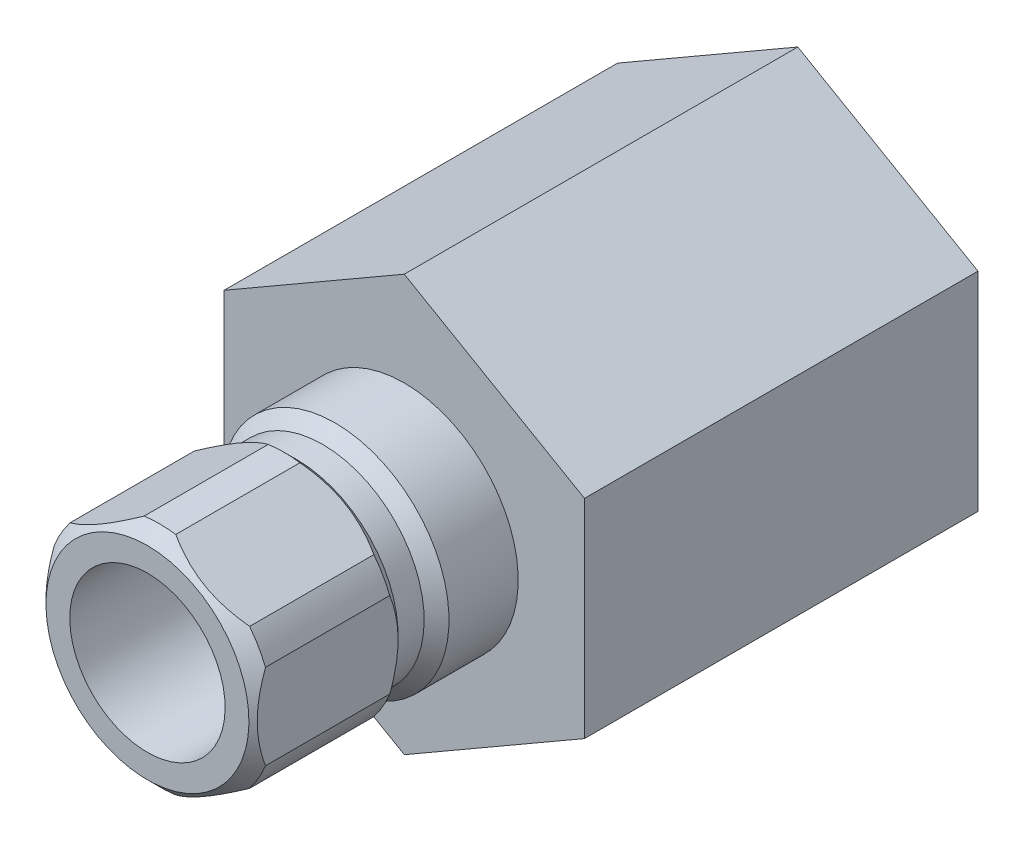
ISO-10303-21;
HEADER;
FILE_DESCRIPTION(('STEP AP214'),'2;1');
FILE_NAME('part.step','',(''),(''),'','','');
FILE_SCHEMA(('AUTOMOTIVE_DESIGN { 1 0 10303 214 1 1 1 1 }'));
ENDSEC;
DATA;
#1=APPLICATION_CONTEXT('core data for automotive mechanical design processes');
#2=APPLICATION_PROTOCOL_DEFINITION('international standard','automotive_design',2000,#1);
#3=PRODUCT_CONTEXT('',#1,'mechanical');
#4=PRODUCT('Part','Part','',(#3));
#5=PRODUCT_RELATED_PRODUCT_CATEGORY('part','',(#4));
#6=PRODUCT_DEFINITION_FORMATION('','',#4);
#7=PRODUCT_DEFINITION_CONTEXT('part definition',#1,'design');
#8=PRODUCT_DEFINITION('design','',#6,#7);
#9=PRODUCT_DEFINITION_SHAPE('','',#8);
#10=(LENGTH_UNIT() NAMED_UNIT(*) SI_UNIT(.MILLI.,.METRE.));
#11=(NAMED_UNIT(*) PLANE_ANGLE_UNIT() SI_UNIT($,.RADIAN.));
#12=(NAMED_UNIT(*) SI_UNIT($,.STERADIAN.) SOLID_ANGLE_UNIT());
#13=UNCERTAINTY_MEASURE_WITH_UNIT(LENGTH_MEASURE(1.E-05),#10,'distance_accuracy_value','');
#14=(GEOMETRIC_REPRESENTATION_CONTEXT(3) GLOBAL_UNCERTAINTY_ASSIGNED_CONTEXT((#13)) GLOBAL_UNIT_ASSIGNED_CONTEXT((#10,
#11,#12)) REPRESENTATION_CONTEXT('',''));
#15=CARTESIAN_POINT('',(0.,0.,0.));
#16=DIRECTION('',(0.,0.,1.));
#17=DIRECTION('',(1.,0.,0.));
#18=AXIS2_PLACEMENT_3D('',#15,#16,#17);
#19=CARTESIAN_POINT('',(0.,0.,0.));
#20=DIRECTION('',(0.,0.,-1.));
#21=DIRECTION('',(0.,1.,0.));
#22=AXIS2_PLACEMENT_3D('',#19,#20,#21);
#23=CYLINDRICAL_SURFACE('',#22,6.985);
#24=DIRECTION('',(0.,0.,-1.));
#25=VECTOR('',#24,1.);
#26=CARTESIAN_POINT('',(-5.50323442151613,4.30170151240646,0.));
#27=LINE('',#26,#25);
#28=CARTESIAN_POINT('',(-5.50323442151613,4.30170151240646,7.366));
#29=VERTEX_POINT('',#28);
#30=CARTESIAN_POINT('',(-5.50323442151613,4.30170151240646,14.986));
#31=VERTEX_POINT('',#30);
#32=EDGE_CURVE('E54',#29,#31,#27,.F.);
#33=ORIENTED_EDGE('',*,*,#32,.F.);
#34=CARTESIAN_POINT('',(0.,0.,7.366));
#35=DIRECTION('',(0.,0.,-1.));
#36=DIRECTION('',(0.,1.,0.));
#37=AXIS2_PLACEMENT_3D('',#34,#35,#36);
#38=CIRCLE('',#37,6.985);
#39=CARTESIAN_POINT('',(-6.477,2.6150900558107,7.366));
#40=VERTEX_POINT('',#39);
#41=EDGE_CURVE('E195',#40,#29,#38,.T.);
#42=ORIENTED_EDGE('',*,*,#41,.F.);
#43=DIRECTION('',(0.,0.,-1.));
#44=VECTOR('',#43,1.);
#45=CARTESIAN_POINT('',(-6.477,2.6150900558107,0.));
#46=LINE('',#45,#44);
#47=CARTESIAN_POINT('',(-6.477,2.6150900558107,14.986));
#48=VERTEX_POINT('',#47);
#49=EDGE_CURVE('E375',#48,#40,#46,.T.);
#50=ORIENTED_EDGE('',*,*,#49,.F.);
#51=CARTESIAN_POINT('',(0.,0.,14.986));
#52=DIRECTION('',(0.,0.,-1.));
#53=DIRECTION('',(0.,1.,0.));
#54=AXIS2_PLACEMENT_3D('',#51,#52,#53);
#55=CIRCLE('',#54,6.985);
#56=EDGE_CURVE('E200',#48,#31,#55,.T.);
#57=ORIENTED_EDGE('',*,*,#56,.T.);
#58=EDGE_LOOP('',(#33,#42,#50,#57));
#59=FACE_BOUND('',#58,.T.);
#60=ADVANCED_FACE('F35',(#59),#23,.T.);
#61=DIRECTION('',(0.,0.,-1.));
#62=VECTOR('',#61,1.);
#63=CARTESIAN_POINT('',(-6.477,-2.6150900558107,0.));
#64=LINE('',#63,#62);
#65=CARTESIAN_POINT('',(-6.477,-2.6150900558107,7.366));
#66=VERTEX_POINT('',#65);
#67=CARTESIAN_POINT('',(-6.477,-2.6150900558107,14.986));
#68=VERTEX_POINT('',#67);
#69=EDGE_CURVE('E62',#66,#68,#64,.F.);
#70=ORIENTED_EDGE('',*,*,#69,.F.);
#71=CARTESIAN_POINT('',(-5.50323442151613,-4.30170151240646,7.366));
#72=VERTEX_POINT('',#71);
#73=EDGE_CURVE('E432',#72,#66,#38,.T.);
#74=ORIENTED_EDGE('',*,*,#73,.F.);
#75=DIRECTION('',(0.,0.,-1.));
#76=VECTOR('',#75,1.);
#77=CARTESIAN_POINT('',(-5.50323442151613,-4.30170151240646,0.));
#78=LINE('',#77,#76);
#79=CARTESIAN_POINT('',(-5.50323442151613,-4.30170151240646,14.986));
#80=VERTEX_POINT('',#79);
#81=EDGE_CURVE('E370',#80,#72,#78,.T.);
#82=ORIENTED_EDGE('',*,*,#81,.F.);
#83=EDGE_CURVE('E205',#80,#68,#55,.T.);
#84=ORIENTED_EDGE('',*,*,#83,.T.);
#85=EDGE_LOOP('',(#70,#74,#82,#84));
#86=FACE_BOUND('',#85,.T.);
#87=ADVANCED_FACE('F367',(#86),#23,.T.);
#88=DIRECTION('',(0.,0.,-1.));
#89=VECTOR('',#88,1.);
#90=CARTESIAN_POINT('',(-0.973765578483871,-6.91679156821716,0.));
#91=LINE('',#90,#89);
#92=CARTESIAN_POINT('',(-0.973765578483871,-6.91679156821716,7.366));
#93=VERTEX_POINT('',#92);
#94=CARTESIAN_POINT('',(-0.973765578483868,-6.91679156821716,14.986));
#95=VERTEX_POINT('',#94);
#96=EDGE_CURVE('E381',#93,#95,#91,.F.);
#97=ORIENTED_EDGE('',*,*,#96,.F.);
#98=CARTESIAN_POINT('',(0.973765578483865,-6.91679156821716,7.366));
#99=VERTEX_POINT('',#98);
#100=EDGE_CURVE('E430',#99,#93,#38,.T.);
#101=ORIENTED_EDGE('',*,*,#100,.F.);
#102=DIRECTION('',(0.,0.,-1.));
#103=VECTOR('',#102,1.);
#104=CARTESIAN_POINT('',(0.973765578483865,-6.91679156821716,0.));
#105=LINE('',#104,#103);
#106=CARTESIAN_POINT('',(0.973765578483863,-6.91679156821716,14.986));
#107=VERTEX_POINT('',#106);
#108=EDGE_CURVE('E416',#107,#99,#105,.T.);
#109=ORIENTED_EDGE('',*,*,#108,.F.);
#110=EDGE_CURVE('E198',#107,#95,#55,.T.);
#111=ORIENTED_EDGE('',*,*,#110,.T.);
#112=EDGE_LOOP('',(#97,#101,#109,#111));
#113=FACE_BOUND('',#112,.T.);
#114=ADVANCED_FACE('F429',(#113),#23,.T.);
#115=DIRECTION('',(0.,0.,-1.));
#116=VECTOR('',#115,1.);
#117=CARTESIAN_POINT('',(5.50323442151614,-4.30170151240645,0.));
#118=LINE('',#117,#116);
#119=CARTESIAN_POINT('',(5.50323442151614,-4.30170151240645,7.366));
#120=VERTEX_POINT('',#119);
#121=CARTESIAN_POINT('',(5.50323442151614,-4.30170151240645,14.986));
#122=VERTEX_POINT('',#121);
#123=EDGE_CURVE('E418',#120,#122,#118,.F.);
#124=ORIENTED_EDGE('',*,*,#123,.F.);
#125=CARTESIAN_POINT('',(6.477,-2.6150900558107,7.366));
#126=VERTEX_POINT('',#125);
#127=EDGE_CURVE('E357',#126,#120,#38,.T.);
#128=ORIENTED_EDGE('',*,*,#127,.F.);
#129=DIRECTION('',(0.,0.,-1.));
#130=VECTOR('',#129,1.);
#131=CARTESIAN_POINT('',(6.477,-2.6150900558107,0.));
#132=LINE('',#131,#130);
#133=CARTESIAN_POINT('',(6.477,-2.6150900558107,14.986));
#134=VERTEX_POINT('',#133);
#135=EDGE_CURVE('E349',#134,#126,#132,.T.);
#136=ORIENTED_EDGE('',*,*,#135,.F.);
#137=EDGE_CURVE('E191',#134,#122,#55,.T.);
#138=ORIENTED_EDGE('',*,*,#137,.T.);
#139=EDGE_LOOP('',(#124,#128,#136,#138));
#140=FACE_BOUND('',#139,.T.);
#141=ADVANCED_FACE('F355',(#140),#23,.T.);
#142=DIRECTION('',(0.,0.,-1.));
#143=VECTOR('',#142,1.);
#144=CARTESIAN_POINT('',(6.477,2.6150900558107,0.));
#145=LINE('',#144,#143);
#146=CARTESIAN_POINT('',(6.477,2.6150900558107,7.366));
#147=VERTEX_POINT('',#146);
#148=CARTESIAN_POINT('',(6.477,2.6150900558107,14.986));
#149=VERTEX_POINT('',#148);
#150=EDGE_CURVE('E351',#147,#149,#145,.F.);
#151=ORIENTED_EDGE('',*,*,#150,.F.);
#152=CARTESIAN_POINT('',(5.50323442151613,4.30170151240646,7.366));
#153=VERTEX_POINT('',#152);
#154=EDGE_CURVE('E184',#153,#147,#38,.T.);
#155=ORIENTED_EDGE('',*,*,#154,.F.);
#156=DIRECTION('',(0.,0.,-1.));
#157=VECTOR('',#156,1.);
#158=CARTESIAN_POINT('',(5.50323442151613,4.30170151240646,0.));
#159=LINE('',#158,#157);
#160=CARTESIAN_POINT('',(5.50323442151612,4.30170151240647,14.986));
#161=VERTEX_POINT('',#160);
#162=EDGE_CURVE('E166',#161,#153,#159,.T.);
#163=ORIENTED_EDGE('',*,*,#162,.F.);
#164=EDGE_CURVE('E182',#161,#149,#55,.T.);
#165=ORIENTED_EDGE('',*,*,#164,.T.);
#166=EDGE_LOOP('',(#151,#155,#163,#165));
#167=FACE_BOUND('',#166,.T.);
#168=ADVANCED_FACE('F181',(#167),#23,.T.);
#169=CARTESIAN_POINT('',(0.,13.208,-24.13));
#170=DIRECTION('',(0.,0.,-1.));
#171=DIRECTION('',(0.,1.,0.));
#172=AXIS2_PLACEMENT_3D('',#169,#170,#171);
#173=PLANE('',#172);
#174=CARTESIAN_POINT('',(0.,0.,-24.13));
#175=DIRECTION('',(0.,0.,-1.));
#176=DIRECTION('',(0.,1.,0.));
#177=AXIS2_PLACEMENT_3D('',#174,#175,#176);
#178=CIRCLE('',#177,9.40283906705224);
#179=CARTESIAN_POINT('',(0.,9.40283906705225,-24.13));
#180=VERTEX_POINT('',#179);
#181=EDGE_CURVE('E446',#180,#180,#178,.T.);
#182=ORIENTED_EDGE('',*,*,#181,.F.);
#183=EDGE_LOOP('',(#182));
#184=FACE_BOUND('',#183,.T.);
#185=DIRECTION('',(0.,-1.,0.));
#186=VECTOR('',#185,1.);
#187=CARTESIAN_POINT('',(-11.049,6.37914312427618,-24.13));
#188=LINE('',#187,#186);
#189=CARTESIAN_POINT('',(-11.049,6.37914312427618,-24.13));
#190=VERTEX_POINT('',#189);
#191=CARTESIAN_POINT('',(-11.049,-6.37914312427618,-24.13));
#192=VERTEX_POINT('',#191);
#193=EDGE_CURVE('E257',#190,#192,#188,.T.);
#194=ORIENTED_EDGE('',*,*,#193,.F.);
#195=DIRECTION('',(-0.866025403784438,-0.5,0.));
#196=VECTOR('',#195,1.);
#197=CARTESIAN_POINT('',(0.,12.7582862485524,-24.13));
#198=LINE('',#197,#196);
#199=CARTESIAN_POINT('',(0.,12.7582862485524,-24.13));
#200=VERTEX_POINT('',#199);
#201=EDGE_CURVE('E229',#200,#190,#198,.T.);
#202=ORIENTED_EDGE('',*,*,#201,.F.);
#203=DIRECTION('',(-0.866025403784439,0.5,0.));
#204=VECTOR('',#203,1.);
#205=CARTESIAN_POINT('',(11.049,6.37914312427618,-24.13));
#206=LINE('',#205,#204);
#207=CARTESIAN_POINT('',(11.049,6.37914312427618,-24.13));
#208=VERTEX_POINT('',#207);
#209=EDGE_CURVE('E216',#208,#200,#206,.T.);
#210=ORIENTED_EDGE('',*,*,#209,.F.);
#211=DIRECTION('',(0.,1.,0.));
#212=VECTOR('',#211,1.);
#213=CARTESIAN_POINT('',(11.049,-6.37914312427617,-24.13));
#214=LINE('',#213,#212);
#215=CARTESIAN_POINT('',(11.049,-6.37914312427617,-24.13));
#216=VERTEX_POINT('',#215);
#217=EDGE_CURVE('E248',#216,#208,#214,.T.);
#218=ORIENTED_EDGE('',*,*,#217,.F.);
#219=DIRECTION('',(0.866025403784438,0.5,0.));
#220=VECTOR('',#219,1.);
#221=CARTESIAN_POINT('',(0.,-12.7582862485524,-24.13));
#222=LINE('',#221,#220);
#223=CARTESIAN_POINT('',(0.,-12.7582862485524,-24.13));
#224=VERTEX_POINT('',#223);
#225=EDGE_CURVE('E251',#224,#216,#222,.T.);
#226=ORIENTED_EDGE('',*,*,#225,.F.);
#227=DIRECTION('',(0.866025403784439,-0.5,0.));
#228=VECTOR('',#227,1.);
#229=CARTESIAN_POINT('',(-11.049,-6.37914312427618,-24.13));
#230=LINE('',#229,#228);
#231=EDGE_CURVE('E254',#192,#224,#230,.T.);
#232=ORIENTED_EDGE('',*,*,#231,.F.);
#233=EDGE_LOOP('',(#194,#202,#210,#218,#226,#232));
#234=FACE_BOUND('',#233,.T.);
#235=ADVANCED_FACE('F478',(#184,#234),#173,.T.);
#236=CARTESIAN_POINT('',(0.,6.985,0.));
#237=DIRECTION('',(0.,0.,1.));
#238=DIRECTION('',(0.,-1.,0.));
#239=AXIS2_PLACEMENT_3D('',#236,#237,#238);
#240=PLANE('',#239);
#241=CARTESIAN_POINT('',(0.,0.,0.));
#242=DIRECTION('',(0.,0.,-1.));
#243=DIRECTION('',(0.,1.,0.));
#244=AXIS2_PLACEMENT_3D('',#241,#242,#243);
#245=CIRCLE('',#244,6.985);
#246=CARTESIAN_POINT('',(0.,6.985,0.));
#247=VERTEX_POINT('',#246);
#248=EDGE_CURVE('E443',#247,#247,#245,.T.);
#249=ORIENTED_EDGE('',*,*,#248,.T.);
#250=EDGE_LOOP('',(#249));
#251=FACE_BOUND('',#250,.T.);
#252=DIRECTION('',(-0.866025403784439,0.5,0.));
#253=VECTOR('',#252,1.);
#254=CARTESIAN_POINT('',(11.049,6.37914312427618,0.));
#255=LINE('',#254,#253);
#256=CARTESIAN_POINT('',(11.049,6.37914312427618,0.));
#257=VERTEX_POINT('',#256);
#258=CARTESIAN_POINT('',(0.,12.7582862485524,0.));
#259=VERTEX_POINT('',#258);
#260=EDGE_CURVE('E226',#257,#259,#255,.T.);
#261=ORIENTED_EDGE('',*,*,#260,.T.);
#262=DIRECTION('',(-0.866025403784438,-0.5,0.));
#263=VECTOR('',#262,1.);
#264=CARTESIAN_POINT('',(0.,12.7582862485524,0.));
#265=LINE('',#264,#263);
#266=CARTESIAN_POINT('',(-11.049,6.37914312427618,0.));
#267=VERTEX_POINT('',#266);
#268=EDGE_CURVE('E242',#259,#267,#265,.T.);
#269=ORIENTED_EDGE('',*,*,#268,.T.);
#270=DIRECTION('',(0.,-1.,0.));
#271=VECTOR('',#270,1.);
#272=CARTESIAN_POINT('',(-11.049,6.37914312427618,0.));
#273=LINE('',#272,#271);
#274=CARTESIAN_POINT('',(-11.049,-6.37914312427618,0.));
#275=VERTEX_POINT('',#274);
#276=EDGE_CURVE('E239',#267,#275,#273,.T.);
#277=ORIENTED_EDGE('',*,*,#276,.T.);
#278=DIRECTION('',(0.866025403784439,-0.5,0.));
#279=VECTOR('',#278,1.);
#280=CARTESIAN_POINT('',(-11.049,-6.37914312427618,0.));
#281=LINE('',#280,#279);
#282=CARTESIAN_POINT('',(0.,-12.7582862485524,0.));
#283=VERTEX_POINT('',#282);
#284=EDGE_CURVE('E236',#275,#283,#281,.T.);
#285=ORIENTED_EDGE('',*,*,#284,.T.);
#286=DIRECTION('',(0.866025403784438,0.5,0.));
#287=VECTOR('',#286,1.);
#288=CARTESIAN_POINT('',(0.,-12.7582862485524,0.));
#289=LINE('',#288,#287);
#290=CARTESIAN_POINT('',(11.049,-6.37914312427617,0.));
#291=VERTEX_POINT('',#290);
#292=EDGE_CURVE('E233',#283,#291,#289,.T.);
#293=ORIENTED_EDGE('',*,*,#292,.T.);
#294=DIRECTION('',(0.,1.,0.));
#295=VECTOR('',#294,1.);
#296=CARTESIAN_POINT('',(11.049,-6.37914312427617,0.));
#297=LINE('',#296,#295);
#298=EDGE_CURVE('E230',#291,#257,#297,.T.);
#299=ORIENTED_EDGE('',*,*,#298,.T.);
#300=EDGE_LOOP('',(#261,#269,#277,#285,#293,#299));
#301=FACE_BOUND('',#300,.T.);
#302=ADVANCED_FACE('F467',(#251,#301),#240,.T.);
#303=CARTESIAN_POINT('',(0.,0.,0.));
#304=DIRECTION('',(0.,0.,-1.));
#305=DIRECTION('',(0.,1.,0.));
#306=AXIS2_PLACEMENT_3D('',#303,#304,#305);
#307=CYLINDRICAL_SURFACE('',#306,4.7625);
#308=CARTESIAN_POINT('',(0.,0.,-8.97890000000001));
#309=DIRECTION('',(0.,0.,-1.));
#310=DIRECTION('',(0.,1.,0.));
#311=AXIS2_PLACEMENT_3D('',#308,#309,#310);
#312=CIRCLE('',#311,4.7625);
#313=CARTESIAN_POINT('',(0.,4.7625,-8.97890000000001));
#314=VERTEX_POINT('',#313);
#315=EDGE_CURVE('E175',#314,#314,#312,.T.);
#316=ORIENTED_EDGE('',*,*,#315,.T.);
#317=EDGE_LOOP('',(#316));
#318=FACE_BOUND('',#317,.T.);
#319=CARTESIAN_POINT('',(0.,0.,15.748));
#320=DIRECTION('',(0.,0.,-1.));
#321=DIRECTION('',(0.,1.,0.));
#322=AXIS2_PLACEMENT_3D('',#319,#320,#321);
#323=CIRCLE('',#322,4.7625);
#324=CARTESIAN_POINT('',(0.,4.7625,15.748));
#325=VERTEX_POINT('',#324);
#326=EDGE_CURVE('E207',#325,#325,#323,.T.);
#327=ORIENTED_EDGE('',*,*,#326,.F.);
#328=EDGE_LOOP('',(#327));
#329=FACE_BOUND('',#328,.T.);
#330=ADVANCED_FACE('F37',(#318,#329),#307,.F.);
#331=CARTESIAN_POINT('',(0.,4.7625,-8.97890000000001));
#332=DIRECTION('',(0.,0.,-1.));
#333=DIRECTION('',(0.,1.,0.));
#334=AXIS2_PLACEMENT_3D('',#331,#332,#333);
#335=PLANE('',#334);
#336=CARTESIAN_POINT('',(0.,0.,-8.97890000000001));
#337=DIRECTION('',(0.,0.,-1.));
#338=DIRECTION('',(0.,1.,0.));
#339=AXIS2_PLACEMENT_3D('',#336,#337,#338);
#340=CIRCLE('',#339,8.92937);
#341=CARTESIAN_POINT('',(0.,8.92937,-8.97890000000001));
#342=VERTEX_POINT('',#341);
#343=EDGE_CURVE('E449',#342,#342,#340,.T.);
#344=ORIENTED_EDGE('',*,*,#343,.T.);
#345=EDGE_LOOP('',(#344));
#346=FACE_BOUND('',#345,.T.);
#347=ORIENTED_EDGE('',*,*,#315,.F.);
#348=EDGE_LOOP('',(#347));
#349=FACE_BOUND('',#348,.T.);
#350=ADVANCED_FACE('F456',(#346,#349),#335,.T.);
#351=CARTESIAN_POINT('',(0.,0.,-8.97890000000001));
#352=DIRECTION('',(0.,0.,-1.));
#353=DIRECTION('',(0.,1.,0.));
#354=AXIS2_PLACEMENT_3D('',#351,#352,#353);
#355=CONICAL_SURFACE('',#354,8.92937,0.0312396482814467);
#356=ORIENTED_EDGE('',*,*,#181,.T.);
#357=EDGE_LOOP('',(#356));
#358=FACE_BOUND('',#357,.T.);
#359=ORIENTED_EDGE('',*,*,#343,.F.);
#360=EDGE_LOOP('',(#359));
#361=FACE_BOUND('',#360,.T.);
#362=ADVANCED_FACE('F458',(#358,#361),#355,.F.);
#363=CARTESIAN_POINT('',(0.,0.,0.));
#364=DIRECTION('',(0.,0.,-1.));
#365=DIRECTION('',(0.,1.,0.));
#366=AXIS2_PLACEMENT_3D('',#363,#364,#365);
#367=CYLINDRICAL_SURFACE('',#366,6.985);
#368=CARTESIAN_POINT('',(0.,0.,4.2418));
#369=DIRECTION('',(0.,0.,-1.));
#370=DIRECTION('',(0.,1.,0.));
#371=AXIS2_PLACEMENT_3D('',#368,#369,#370);
#372=CIRCLE('',#371,6.985);
#373=CARTESIAN_POINT('',(0.,6.985,4.2418));
#374=VERTEX_POINT('',#373);
#375=EDGE_CURVE('E440',#374,#374,#372,.T.);
#376=ORIENTED_EDGE('',*,*,#375,.T.);
#377=EDGE_LOOP('',(#376));
#378=FACE_BOUND('',#377,.T.);
#379=ORIENTED_EDGE('',*,*,#248,.F.);
#380=EDGE_LOOP('',(#379));
#381=FACE_BOUND('',#380,.T.);
#382=ADVANCED_FACE('F464',(#378,#381),#367,.T.);
#383=CARTESIAN_POINT('',(0.,0.,4.2418));
#384=DIRECTION('',(0.,0.,-1.));
#385=DIRECTION('',(0.,1.,0.));
#386=AXIS2_PLACEMENT_3D('',#383,#384,#385);
#387=CONICAL_SURFACE('',#386,6.985,0.785398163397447);
#388=CARTESIAN_POINT('',(0.,0.,5.0038));
#389=DIRECTION('',(0.,0.,-1.));
#390=DIRECTION('',(0.,1.,0.));
#391=AXIS2_PLACEMENT_3D('',#388,#389,#390);
#392=CIRCLE('',#391,6.223);
#393=CARTESIAN_POINT('',(0.,6.223,5.0038));
#394=VERTEX_POINT('',#393);
#395=EDGE_CURVE('E437',#394,#394,#392,.T.);
#396=ORIENTED_EDGE('',*,*,#395,.T.);
#397=EDGE_LOOP('',(#396));
#398=FACE_BOUND('',#397,.T.);
#399=ORIENTED_EDGE('',*,*,#375,.F.);
#400=EDGE_LOOP('',(#399));
#401=FACE_BOUND('',#400,.T.);
#402=ADVANCED_FACE('F567',(#398,#401),#387,.T.);
#403=CARTESIAN_POINT('',(0.,0.,0.));
#404=DIRECTION('',(0.,0.,-1.));
#405=DIRECTION('',(0.,1.,0.));
#406=AXIS2_PLACEMENT_3D('',#403,#404,#405);
#407=CYLINDRICAL_SURFACE('',#406,6.223);
#408=CARTESIAN_POINT('',(0.,0.,6.604));
#409=DIRECTION('',(0.,0.,-1.));
#410=DIRECTION('',(0.,1.,0.));
#411=AXIS2_PLACEMENT_3D('',#408,#409,#410);
#412=CIRCLE('',#411,6.223);
#413=CARTESIAN_POINT('',(0.,6.223,6.604));
#414=VERTEX_POINT('',#413);
#415=EDGE_CURVE('E434',#414,#414,#412,.T.);
#416=ORIENTED_EDGE('',*,*,#415,.T.);
#417=EDGE_LOOP('',(#416));
#418=FACE_BOUND('',#417,.T.);
#419=ORIENTED_EDGE('',*,*,#395,.F.);
#420=EDGE_LOOP('',(#419));
#421=FACE_BOUND('',#420,.T.);
#422=ADVANCED_FACE('F476',(#418,#421),#407,.T.);
#423=CARTESIAN_POINT('',(0.,0.,6.604));
#424=DIRECTION('',(0.,0.,1.));
#425=DIRECTION('',(0.,-1.,0.));
#426=AXIS2_PLACEMENT_3D('',#423,#424,#425);
#427=CONICAL_SURFACE('',#426,6.223,0.785398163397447);
#428=CARTESIAN_POINT('',(-0.973302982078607,6.91705864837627,7.3662));
#429=CARTESIAN_POINT('',(-1.15430521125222,6.81255696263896,7.28788330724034));
#430=CARTESIAN_POINT('',(-1.33782092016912,6.70660411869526,7.21664558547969));
#431=CARTESIAN_POINT('',(-1.70963160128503,6.49193912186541,7.09114753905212));
#432=CARTESIAN_POINT('',(-1.89793754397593,6.38322063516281,7.03693086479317));
#433=CARTESIAN_POINT('',(-2.27146153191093,6.16756646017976,6.95027563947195));
#434=CARTESIAN_POINT('',(-2.45655498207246,6.06070270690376,6.91713772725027));
#435=CARTESIAN_POINT('',(-2.82844640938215,5.8459910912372,6.87178043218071));
#436=CARTESIAN_POINT('',(-3.01524193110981,5.73814464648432,6.85953461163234));
#437=CARTESIAN_POINT('',(-3.39480578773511,5.51900335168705,6.85669437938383));
#438=CARTESIAN_POINT('',(-3.58757842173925,5.40770601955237,6.86678827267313));
#439=CARTESIAN_POINT('',(-3.97148128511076,5.18605959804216,6.9093291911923));
#440=CARTESIAN_POINT('',(-4.16260891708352,5.07571200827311,6.9418066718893));
#441=CARTESIAN_POINT('',(-4.54854122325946,4.85289388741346,7.02857263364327));
#442=CARTESIAN_POINT('',(-4.74321398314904,4.74049951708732,7.083635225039));
#443=CARTESIAN_POINT('',(-5.03141021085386,4.5741093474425,7.1799920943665));
#444=CARTESIAN_POINT('',(-5.12673323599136,4.5190745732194,7.21435772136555));
#445=CARTESIAN_POINT('',(-5.31613879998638,4.40972121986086,7.28725547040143));
#446=CARTESIAN_POINT('',(-5.41022179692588,4.35540237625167,7.32578600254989));
#447=CARTESIAN_POINT('',(-5.50369701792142,4.30143443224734,7.36620000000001));
#448=B_SPLINE_CURVE_WITH_KNOTS('',3,(#428,#429,#430,#431,#432,#433,#434,#435,#436,#437,#438,
#439,#440,#441,#442,#443,#444,#445,#446,#447),.UNSPECIFIED.,.F.,.F.,(4,2,2,2,2,2,2,2,2,4),(0.,
0.669810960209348,1.34132587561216,1.9892054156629,2.63626449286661,3.3035366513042,
3.9717185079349,4.66502165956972,5.0108826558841,5.35661208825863),.UNSPECIFIED.);
#449=CARTESIAN_POINT('',(-0.973765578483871,6.91679156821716,7.366));
#450=VERTEX_POINT('',#449);
#451=EDGE_CURVE('E245',#450,#29,#448,.T.);
#452=ORIENTED_EDGE('',*,*,#451,.F.);
#453=CARTESIAN_POINT('',(0.973765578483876,6.91679156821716,7.366));
#454=VERTEX_POINT('',#453);
#455=EDGE_CURVE('E190',#450,#454,#38,.T.);
#456=ORIENTED_EDGE('',*,*,#455,.T.);
#457=CARTESIAN_POINT('',(5.50369701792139,4.30143443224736,7.3662));
#458=CARTESIAN_POINT('',(5.32269478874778,4.40593611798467,7.28788330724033));
#459=CARTESIAN_POINT('',(5.13917907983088,4.51188896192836,7.21664558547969));
#460=CARTESIAN_POINT('',(4.76736839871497,4.72655395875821,7.09114753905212));
#461=CARTESIAN_POINT('',(4.57906245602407,4.83527244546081,7.03693086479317));
#462=CARTESIAN_POINT('',(4.20553846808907,5.05092662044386,6.95027563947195));
#463=CARTESIAN_POINT('',(4.02044501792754,5.15779037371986,6.91713772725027));
#464=CARTESIAN_POINT('',(3.64855359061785,5.37250198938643,6.87178043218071));
#465=CARTESIAN_POINT('',(3.46175806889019,5.48034843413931,6.85953461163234));
#466=CARTESIAN_POINT('',(3.08219421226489,5.69948972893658,6.85669437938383));
#467=CARTESIAN_POINT('',(2.88942157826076,5.81078706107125,6.86678827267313));
#468=CARTESIAN_POINT('',(2.50551871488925,6.03243348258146,6.9093291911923));
#469=CARTESIAN_POINT('',(2.31439108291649,6.14278107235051,6.9418066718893));
#470=CARTESIAN_POINT('',(1.92845877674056,6.36559919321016,7.02857263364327));
#471=CARTESIAN_POINT('',(1.73378601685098,6.47799356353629,7.08363522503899));
#472=CARTESIAN_POINT('',(1.44558978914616,6.6443837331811,7.17999209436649));
#473=CARTESIAN_POINT('',(1.35026676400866,6.69941850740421,7.21435772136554));
#474=CARTESIAN_POINT('',(1.16086120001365,6.80877186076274,7.28725547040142));
#475=CARTESIAN_POINT('',(1.06677820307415,6.86309070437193,7.32578600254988));
#476=CARTESIAN_POINT('',(0.97330298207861,6.91705864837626,7.3662));
#477=B_SPLINE_CURVE_WITH_KNOTS('',3,(#457,#458,#459,#460,#461,#462,#463,#464,#465,#466,#467,
#468,#469,#470,#471,#472,#473,#474,#475,#476),.UNSPECIFIED.,.F.,.F.,(4,2,2,2,2,2,2,2,2,4),(0.,
0.669810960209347,1.34132587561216,1.9892054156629,2.63626449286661,3.30353665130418,
3.97171850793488,4.66502165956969,5.01088265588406,5.35661208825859),.UNSPECIFIED.);
#478=EDGE_CURVE('E358',#153,#454,#477,.T.);
#479=ORIENTED_EDGE('',*,*,#478,.F.);
#480=ORIENTED_EDGE('',*,*,#154,.T.);
#481=CARTESIAN_POINT('',(6.477,-7.50531717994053,10.2946933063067));
#482=CARTESIAN_POINT('',(6.477,-7.32278230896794,10.1565337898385));
#483=CARTESIAN_POINT('',(6.477,-7.13923073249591,10.0196957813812));
#484=CARTESIAN_POINT('',(6.477,-6.76969107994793,9.74925615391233));
#485=CARTESIAN_POINT('',(6.477,-6.58370240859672,9.61565534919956));
#486=CARTESIAN_POINT('',(6.477,-6.20752484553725,9.35133325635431));
#487=CARTESIAN_POINT('',(6.477,-6.01731457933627,9.22064228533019));
#488=CARTESIAN_POINT('',(6.477,-5.63367369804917,8.96409124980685));
#489=CARTESIAN_POINT('',(6.477,-5.44024331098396,8.83823084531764));
#490=CARTESIAN_POINT('',(6.477,-5.03831720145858,8.58528971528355));
#491=CARTESIAN_POINT('',(6.477,-4.8295984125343,8.45856164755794));
#492=CARTESIAN_POINT('',(6.477,-4.40728395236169,8.21337587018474));
#493=CARTESIAN_POINT('',(6.477,-4.19368750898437,8.09491948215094));
#494=CARTESIAN_POINT('',(6.477,-3.7616267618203,7.8688284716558));
#495=CARTESIAN_POINT('',(6.477,-3.54317924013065,7.76116202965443));
#496=CARTESIAN_POINT('',(6.477,-3.100295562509,7.55906153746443));
#497=CARTESIAN_POINT('',(6.477,-2.87586219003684,7.46462146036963));
#498=CARTESIAN_POINT('',(6.477,-2.43955826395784,7.2995033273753));
#499=CARTESIAN_POINT('',(6.477,-2.22819339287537,7.2275028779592));
#500=CARTESIAN_POINT('',(6.477,-1.80033354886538,7.10045249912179));
#501=CARTESIAN_POINT('',(6.477,-1.58383822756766,7.0454037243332));
#502=CARTESIAN_POINT('',(6.477,-1.15063390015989,6.95606140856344));
#503=CARTESIAN_POINT('',(6.477,-0.934000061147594,6.92140936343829));
#504=CARTESIAN_POINT('',(6.477,-0.498364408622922,6.87354056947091));
#505=CARTESIAN_POINT('',(6.477,-0.279363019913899,6.86032003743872));
#506=CARTESIAN_POINT('',(6.477,0.150697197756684,6.85631642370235));
#507=CARTESIAN_POINT('',(6.477,0.36174869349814,6.8647176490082));
#508=CARTESIAN_POINT('',(6.477,0.782066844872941,6.90168275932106));
#509=CARTESIAN_POINT('',(6.477,0.991333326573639,6.93024858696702));
#510=CARTESIAN_POINT('',(6.477,1.41010575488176,7.00646246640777));
#511=CARTESIAN_POINT('',(6.477,1.6195513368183,7.05443689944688));
#512=CARTESIAN_POINT('',(6.477,2.03387291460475,7.16689535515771));
#513=CARTESIAN_POINT('',(6.477,2.2387492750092,7.23137805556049));
#514=CARTESIAN_POINT('',(6.477,2.66141718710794,7.38044013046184));
#515=CARTESIAN_POINT('',(6.477,2.87875617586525,7.46628961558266));
#516=CARTESIAN_POINT('',(6.477,3.30779766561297,7.65118196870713));
#517=CARTESIAN_POINT('',(6.477,3.51949749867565,7.75023095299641));
#518=CARTESIAN_POINT('',(6.477,3.9382898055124,7.95916705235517));
#519=CARTESIAN_POINT('',(6.477,4.14536521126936,8.069088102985));
#520=CARTESIAN_POINT('',(6.477,4.55475391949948,8.29734039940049));
#521=CARTESIAN_POINT('',(6.477,4.75706796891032,8.41567031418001));
#522=CARTESIAN_POINT('',(6.477,5.14761370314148,8.65303908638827));
#523=CARTESIAN_POINT('',(6.477,5.33604552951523,8.77175038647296));
#524=CARTESIAN_POINT('',(6.477,5.70967381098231,9.01417488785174));
#525=CARTESIAN_POINT('',(6.477,5.89487001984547,9.13788846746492));
#526=CARTESIAN_POINT('',(6.477,6.26095063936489,9.38840412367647));
#527=CARTESIAN_POINT('',(6.477,6.44185783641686,9.5151730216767));
#528=CARTESIAN_POINT('',(6.477,6.80119835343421,9.77207065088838));
#529=CARTESIAN_POINT('',(6.477,6.97963234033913,9.90219844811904));
#530=CARTESIAN_POINT('',(6.477,7.15703038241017,10.0336997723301));
#531=B_SPLINE_CURVE_WITH_KNOTS('',3,(#481,#482,#483,#484,#485,#486,#487,#488,#489,#490,#491,
#492,#493,#494,#495,#496,#497,#498,#499,#500,#501,#502,#503,#504,#505,#506,#507,#508,#509,#510,
#511,#512,#513,#514,#515,#516,#517,#518,#519,#520,#521,#522,#523,#524,#525,#526,#527,#528,#529,
#530),.UNSPECIFIED.,.F.,.F.,(4,2,2,2,2,2,2,2,2,2,2,2,2,2,2,2,2,2,2,2,2,2,2,2,4),(0.,
0.686790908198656,1.37375281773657,2.06603541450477,2.75826919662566,3.49065471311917,
4.22315698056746,4.95343127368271,5.68337170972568,6.352659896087,7.02199365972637,
7.67918147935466,8.33625327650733,8.96890298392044,9.6016136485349,10.2454384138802,
10.8892116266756,11.5897073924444,12.2905288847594,12.9936114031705,13.6965828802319,
14.3646145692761,15.0326968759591,15.6953618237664,16.3578444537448),.UNSPECIFIED.);
#532=EDGE_CURVE('E411',#126,#147,#531,.T.);
#533=ORIENTED_EDGE('',*,*,#532,.F.);
#534=ORIENTED_EDGE('',*,*,#127,.T.);
#535=CARTESIAN_POINT('',(0.973302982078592,-6.91705864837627,7.3662));
#536=CARTESIAN_POINT('',(1.15430521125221,-6.81255696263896,7.28788330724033));
#537=CARTESIAN_POINT('',(1.33782092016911,-6.70660411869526,7.21664558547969));
#538=CARTESIAN_POINT('',(1.70963160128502,-6.49193912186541,7.09114753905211));
#539=CARTESIAN_POINT('',(1.89793754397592,-6.38322063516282,7.03693086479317));
#540=CARTESIAN_POINT('',(2.27146153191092,-6.16756646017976,6.95027563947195));
#541=CARTESIAN_POINT('',(2.45655498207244,-6.06070270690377,6.91713772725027));
#542=CARTESIAN_POINT('',(2.82844640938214,-5.8459910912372,6.87178043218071));
#543=CARTESIAN_POINT('',(3.0152419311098,-5.73814464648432,6.85953461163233));
#544=CARTESIAN_POINT('',(3.3948057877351,-5.51900335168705,6.85669437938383));
#545=CARTESIAN_POINT('',(3.58757842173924,-5.40770601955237,6.86678827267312));
#546=CARTESIAN_POINT('',(3.97148128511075,-5.18605959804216,6.90932919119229));
#547=CARTESIAN_POINT('',(4.16260891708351,-5.07571200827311,6.94180667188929));
#548=CARTESIAN_POINT('',(4.54854122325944,-4.85289388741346,7.02857263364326));
#549=CARTESIAN_POINT('',(4.74321398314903,-4.74049951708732,7.08363522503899));
#550=CARTESIAN_POINT('',(5.03141021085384,-4.57410934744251,7.17999209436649));
#551=CARTESIAN_POINT('',(5.12673323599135,-4.5190745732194,7.21435772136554));
#552=CARTESIAN_POINT('',(5.31613879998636,-4.40972121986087,7.28725547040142));
#553=CARTESIAN_POINT('',(5.41022179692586,-4.35540237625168,7.32578600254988));
#554=CARTESIAN_POINT('',(5.50369701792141,-4.30143443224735,7.3662));
#555=B_SPLINE_CURVE_WITH_KNOTS('',3,(#535,#536,#537,#538,#539,#540,#541,#542,#543,#544,#545,
#546,#547,#548,#549,#550,#551,#552,#553,#554),.UNSPECIFIED.,.F.,.F.,(4,2,2,2,2,2,2,2,2,4),(0.,
0.669810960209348,1.34132587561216,1.98920541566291,2.63626449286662,3.3035366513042,
3.9717185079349,4.66502165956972,5.0108826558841,5.35661208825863),.UNSPECIFIED.);
#556=EDGE_CURVE('E420',#99,#120,#555,.T.);
#557=ORIENTED_EDGE('',*,*,#556,.F.);
#558=ORIENTED_EDGE('',*,*,#100,.T.);
#559=CARTESIAN_POINT('',(-5.50369701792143,-4.30143443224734,7.36620000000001));
#560=CARTESIAN_POINT('',(-5.32269478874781,-4.40593611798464,7.28788330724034));
#561=CARTESIAN_POINT('',(-5.13917907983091,-4.51188896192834,7.2166455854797));
#562=CARTESIAN_POINT('',(-4.767368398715,-4.72655395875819,7.09114753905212));
#563=CARTESIAN_POINT('',(-4.5790624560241,-4.83527244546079,7.03693086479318));
#564=CARTESIAN_POINT('',(-4.2055384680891,-5.05092662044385,6.95027563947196));
#565=CARTESIAN_POINT('',(-4.02044501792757,-5.15779037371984,6.91713772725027));
#566=CARTESIAN_POINT('',(-3.64855359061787,-5.37250198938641,6.87178043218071));
#567=CARTESIAN_POINT('',(-3.46175806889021,-5.48034843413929,6.85953461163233));
#568=CARTESIAN_POINT('',(-3.08219421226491,-5.69948972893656,6.85669437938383));
#569=CARTESIAN_POINT('',(-2.88942157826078,-5.81078706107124,6.86678827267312));
#570=CARTESIAN_POINT('',(-2.50551871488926,-6.03243348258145,6.90932919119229));
#571=CARTESIAN_POINT('',(-2.3143910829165,-6.1427810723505,6.94180667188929));
#572=CARTESIAN_POINT('',(-1.92845877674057,-6.36559919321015,7.02857263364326));
#573=CARTESIAN_POINT('',(-1.73378601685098,-6.47799356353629,7.08363522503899));
#574=CARTESIAN_POINT('',(-1.44558978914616,-6.6443837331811,7.17999209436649));
#575=CARTESIAN_POINT('',(-1.35026676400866,-6.69941850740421,7.21435772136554));
#576=CARTESIAN_POINT('',(-1.16086120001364,-6.80877186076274,7.28725547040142));
#577=CARTESIAN_POINT('',(-1.06677820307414,-6.86309070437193,7.32578600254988));
#578=CARTESIAN_POINT('',(-0.973302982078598,-6.91705864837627,7.3662));
#579=B_SPLINE_CURVE_WITH_KNOTS('',3,(#559,#560,#561,#562,#563,#564,#565,#566,#567,#568,#569,
#570,#571,#572,#573,#574,#575,#576,#577,#578),.UNSPECIFIED.,.F.,.F.,(4,2,2,2,2,2,2,2,2,4),(0.,
0.669810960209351,1.34132587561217,1.98920541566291,2.63626449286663,3.30353665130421,
3.97171850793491,4.66502165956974,5.01088265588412,5.35661208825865),.UNSPECIFIED.);
#580=EDGE_CURVE('E377',#72,#93,#579,.T.);
#581=ORIENTED_EDGE('',*,*,#580,.F.);
#582=ORIENTED_EDGE('',*,*,#73,.T.);
#583=CARTESIAN_POINT('',(-6.477,-7.50531717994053,10.2946933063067));
#584=CARTESIAN_POINT('',(-6.477,-7.32278230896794,10.1565337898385));
#585=CARTESIAN_POINT('',(-6.477,-7.13923073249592,10.0196957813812));
#586=CARTESIAN_POINT('',(-6.477,-6.76969107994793,9.74925615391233));
#587=CARTESIAN_POINT('',(-6.477,-6.58370240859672,9.61565534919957));
#588=CARTESIAN_POINT('',(-6.477,-6.20752484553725,9.35133325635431));
#589=CARTESIAN_POINT('',(-6.477,-6.01731457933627,9.22064228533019));
#590=CARTESIAN_POINT('',(-6.477,-5.63367369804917,8.96409124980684));
#591=CARTESIAN_POINT('',(-6.477,-5.44024331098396,8.83823084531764));
#592=CARTESIAN_POINT('',(-6.477,-5.03831720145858,8.58528971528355));
#593=CARTESIAN_POINT('',(-6.477,-4.8295984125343,8.45856164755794));
#594=CARTESIAN_POINT('',(-6.477,-4.4072839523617,8.21337587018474));
#595=CARTESIAN_POINT('',(-6.477,-4.19368750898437,8.09491948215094));
#596=CARTESIAN_POINT('',(-6.477,-3.7616267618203,7.8688284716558));
#597=CARTESIAN_POINT('',(-6.477,-3.54317924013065,7.76116202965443));
#598=CARTESIAN_POINT('',(-6.477,-3.100295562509,7.55906153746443));
#599=CARTESIAN_POINT('',(-6.477,-2.87586219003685,7.46462146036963));
#600=CARTESIAN_POINT('',(-6.477,-2.43955826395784,7.2995033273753));
#601=CARTESIAN_POINT('',(-6.477,-2.22819339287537,7.2275028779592));
#602=CARTESIAN_POINT('',(-6.477,-1.80033354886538,7.1004524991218));
#603=CARTESIAN_POINT('',(-6.477,-1.58383822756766,7.0454037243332));
#604=CARTESIAN_POINT('',(-6.477,-1.1506339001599,6.95606140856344));
#605=CARTESIAN_POINT('',(-6.477,-0.934000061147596,6.92140936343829));
#606=CARTESIAN_POINT('',(-6.477,-0.498364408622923,6.87354056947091));
#607=CARTESIAN_POINT('',(-6.477,-0.2793630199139,6.86032003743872));
#608=CARTESIAN_POINT('',(-6.477,0.150697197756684,6.85631642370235));
#609=CARTESIAN_POINT('',(-6.477,0.361748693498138,6.8647176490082));
#610=CARTESIAN_POINT('',(-6.477,0.78206684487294,6.90168275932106));
#611=CARTESIAN_POINT('',(-6.477,0.991333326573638,6.93024858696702));
#612=CARTESIAN_POINT('',(-6.477,1.41010575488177,7.00646246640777));
#613=CARTESIAN_POINT('',(-6.477,1.6195513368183,7.05443689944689));
#614=CARTESIAN_POINT('',(-6.477,2.03387291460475,7.16689535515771));
#615=CARTESIAN_POINT('',(-6.477,2.2387492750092,7.2313780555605));
#616=CARTESIAN_POINT('',(-6.477,2.66141718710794,7.38044013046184));
#617=CARTESIAN_POINT('',(-6.477,2.87875617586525,7.46628961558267));
#618=CARTESIAN_POINT('',(-6.477,3.30779766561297,7.65118196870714));
#619=CARTESIAN_POINT('',(-6.477,3.51949749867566,7.75023095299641));
#620=CARTESIAN_POINT('',(-6.477,3.9382898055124,7.95916705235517));
#621=CARTESIAN_POINT('',(-6.477,4.14536521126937,8.06908810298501));
#622=CARTESIAN_POINT('',(-6.477,4.55475391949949,8.29734039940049));
#623=CARTESIAN_POINT('',(-6.477,4.75706796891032,8.41567031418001));
#624=CARTESIAN_POINT('',(-6.477,5.14761370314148,8.65303908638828));
#625=CARTESIAN_POINT('',(-6.477,5.33604552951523,8.77175038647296));
#626=CARTESIAN_POINT('',(-6.477,5.70967381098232,9.01417488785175));
#627=CARTESIAN_POINT('',(-6.477,5.89487001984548,9.13788846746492));
#628=CARTESIAN_POINT('',(-6.477,6.2609506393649,9.38840412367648));
#629=CARTESIAN_POINT('',(-6.477,6.44185783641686,9.51517302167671));
#630=CARTESIAN_POINT('',(-6.477,6.80119835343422,9.77207065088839));
#631=CARTESIAN_POINT('',(-6.477,6.97963234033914,9.90219844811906));
#632=CARTESIAN_POINT('',(-6.477,7.15703038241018,10.0336997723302));
#633=B_SPLINE_CURVE_WITH_KNOTS('',3,(#583,#584,#585,#586,#587,#588,#589,#590,#591,#592,#593,
#594,#595,#596,#597,#598,#599,#600,#601,#602,#603,#604,#605,#606,#607,#608,#609,#610,#611,#612,
#613,#614,#615,#616,#617,#618,#619,#620,#621,#622,#623,#624,#625,#626,#627,#628,#629,#630,#631,
#632),.UNSPECIFIED.,.F.,.F.,(4,2,2,2,2,2,2,2,2,2,2,2,2,2,2,2,2,2,2,2,2,2,2,2,4),(0.,
0.686790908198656,1.37375281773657,2.06603541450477,2.75826919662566,3.49065471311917,
4.22315698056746,4.95343127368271,5.68337170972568,6.352659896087,7.02199365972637,
7.67918147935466,8.33625327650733,8.96890298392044,9.6016136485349,10.2454384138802,
10.8892116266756,11.5897073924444,12.2905288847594,12.9936114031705,13.6965828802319,
14.3646145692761,15.0326968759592,15.6953618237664,16.3578444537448),.UNSPECIFIED.);
#634=EDGE_CURVE('E379',#40,#66,#633,.F.);
#635=ORIENTED_EDGE('',*,*,#634,.F.);
#636=ORIENTED_EDGE('',*,*,#41,.T.);
#637=EDGE_LOOP('',(#452,#456,#479,#480,#533,#534,#557,#558,#581,#582,#635,#636));
#638=FACE_BOUND('',#637,.T.);
#639=ORIENTED_EDGE('',*,*,#415,.F.);
#640=EDGE_LOOP('',(#639));
#641=FACE_BOUND('',#640,.T.);
#642=ADVANCED_FACE('F267',(#638,#641),#427,.T.);
#643=DIRECTION('',(0.,0.,-1.));
#644=VECTOR('',#643,1.);
#645=CARTESIAN_POINT('',(-0.973765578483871,6.91679156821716,0.));
#646=LINE('',#645,#644);
#647=CARTESIAN_POINT('',(-0.973765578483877,6.91679156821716,14.986));
#648=VERTEX_POINT('',#647);
#649=EDGE_CURVE('E391',#648,#450,#646,.T.);
#650=ORIENTED_EDGE('',*,*,#649,.F.);
#651=CARTESIAN_POINT('',(0.973765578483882,6.91679156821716,14.986));
#652=VERTEX_POINT('',#651);
#653=EDGE_CURVE('E193',#648,#652,#55,.T.);
#654=ORIENTED_EDGE('',*,*,#653,.T.);
#655=DIRECTION('',(0.,0.,-1.));
#656=VECTOR('',#655,1.);
#657=CARTESIAN_POINT('',(0.973765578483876,6.91679156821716,0.));
#658=LINE('',#657,#656);
#659=EDGE_CURVE('E169',#454,#652,#658,.F.);
#660=ORIENTED_EDGE('',*,*,#659,.F.);
#661=ORIENTED_EDGE('',*,*,#455,.F.);
#662=EDGE_LOOP('',(#650,#654,#660,#661));
#663=FACE_BOUND('',#662,.T.);
#664=ADVANCED_FACE('F309',(#663),#23,.T.);
#665=CARTESIAN_POINT('',(0.,0.,14.986));
#666=DIRECTION('',(0.,0.,-1.));
#667=DIRECTION('',(0.,1.,0.));
#668=AXIS2_PLACEMENT_3D('',#665,#666,#667);
#669=CONICAL_SURFACE('',#668,6.985,0.785398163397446);
#670=CARTESIAN_POINT('',(-5.50369701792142,4.30143443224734,14.9858));
#671=CARTESIAN_POINT('',(-5.32269478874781,4.40593611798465,15.0641166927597));
#672=CARTESIAN_POINT('',(-5.13917907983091,4.51188896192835,15.1353544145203));
#673=CARTESIAN_POINT('',(-4.767368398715,4.7265539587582,15.2608524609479));
#674=CARTESIAN_POINT('',(-4.5790624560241,4.83527244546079,15.3150691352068));
#675=CARTESIAN_POINT('',(-4.2055384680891,5.05092662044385,15.401724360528));
#676=CARTESIAN_POINT('',(-4.02044501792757,5.15779037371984,15.4348622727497));
#677=CARTESIAN_POINT('',(-3.64855359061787,5.37250198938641,15.4802195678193));
#678=CARTESIAN_POINT('',(-3.46175806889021,5.48034843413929,15.4924653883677));
#679=CARTESIAN_POINT('',(-3.08219421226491,5.69948972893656,15.4953056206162));
#680=CARTESIAN_POINT('',(-2.88942157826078,5.81078706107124,15.4852117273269));
#681=CARTESIAN_POINT('',(-2.50551871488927,6.03243348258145,15.4426708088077));
#682=CARTESIAN_POINT('',(-2.31439108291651,6.1427810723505,15.4101933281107));
#683=CARTESIAN_POINT('',(-1.92845877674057,6.36559919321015,15.3234273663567));
#684=CARTESIAN_POINT('',(-1.73378601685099,6.47799356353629,15.268364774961));
#685=CARTESIAN_POINT('',(-1.44558978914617,6.6443837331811,15.1720079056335));
#686=CARTESIAN_POINT('',(-1.35026676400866,6.69941850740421,15.1376422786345));
#687=CARTESIAN_POINT('',(-1.16086120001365,6.80877186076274,15.0647445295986));
#688=CARTESIAN_POINT('',(-1.06677820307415,6.86309070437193,15.0262139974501));
#689=CARTESIAN_POINT('',(-0.973302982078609,6.91705864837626,14.9858));
#690=B_SPLINE_CURVE_WITH_KNOTS('',3,(#670,#671,#672,#673,#674,#675,#676,#677,#678,#679,#680,
#681,#682,#683,#684,#685,#686,#687,#688,#689),.UNSPECIFIED.,.F.,.F.,(4,2,2,2,2,2,2,2,2,4),(0.,
0.66981096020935,1.34132587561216,1.98920541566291,2.63626449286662,3.3035366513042,
3.9717185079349,4.66502165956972,5.0108826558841,5.35661208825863),.UNSPECIFIED.);
#691=EDGE_CURVE('E12',#31,#648,#690,.T.);
#692=ORIENTED_EDGE('',*,*,#691,.F.);
#693=ORIENTED_EDGE('',*,*,#56,.F.);
#694=CARTESIAN_POINT('',(-6.477,-7.50531717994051,12.0573066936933));
#695=CARTESIAN_POINT('',(-6.477,-7.32278230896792,12.1954662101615));
#696=CARTESIAN_POINT('',(-6.477,-7.1392307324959,12.3323042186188));
#697=CARTESIAN_POINT('',(-6.477,-6.76969107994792,12.6027438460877));
#698=CARTESIAN_POINT('',(-6.477,-6.5837024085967,12.7363446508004));
#699=CARTESIAN_POINT('',(-6.477,-6.20752484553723,13.0006667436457));
#700=CARTESIAN_POINT('',(-6.477,-6.01731457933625,13.1313577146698));
#701=CARTESIAN_POINT('',(-6.477,-5.63367369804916,13.3879087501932));
#702=CARTESIAN_POINT('',(-6.477,-5.44024331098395,13.5137691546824));
#703=CARTESIAN_POINT('',(-6.477,-5.03831720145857,13.7667102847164));
#704=CARTESIAN_POINT('',(-6.477,-4.82959841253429,13.8934383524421));
#705=CARTESIAN_POINT('',(-6.477,-4.40728395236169,14.1386241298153));
#706=CARTESIAN_POINT('',(-6.477,-4.19368750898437,14.2570805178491));
#707=CARTESIAN_POINT('',(-6.477,-3.7616267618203,14.4831715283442));
#708=CARTESIAN_POINT('',(-6.477,-3.54317924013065,14.5908379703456));
#709=CARTESIAN_POINT('',(-6.477,-3.100295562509,14.7929384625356));
#710=CARTESIAN_POINT('',(-6.477,-2.87586219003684,14.8873785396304));
#711=CARTESIAN_POINT('',(-6.477,-2.43955826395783,15.0524966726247));
#712=CARTESIAN_POINT('',(-6.477,-2.22819339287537,15.1244971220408));
#713=CARTESIAN_POINT('',(-6.477,-1.80033354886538,15.2515475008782));
#714=CARTESIAN_POINT('',(-6.477,-1.58383822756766,15.3065962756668));
#715=CARTESIAN_POINT('',(-6.477,-1.1506339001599,15.3959385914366));
#716=CARTESIAN_POINT('',(-6.477,-0.934000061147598,15.4305906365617));
#717=CARTESIAN_POINT('',(-6.477,-0.498364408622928,15.4784594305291));
#718=CARTESIAN_POINT('',(-6.477,-0.279363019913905,15.4916799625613));
#719=CARTESIAN_POINT('',(-6.477,0.150697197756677,15.4956835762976));
#720=CARTESIAN_POINT('',(-6.477,0.361748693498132,15.4872823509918));
#721=CARTESIAN_POINT('',(-6.477,0.782066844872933,15.4503172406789));
#722=CARTESIAN_POINT('',(-6.477,0.991333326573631,15.421751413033));
#723=CARTESIAN_POINT('',(-6.477,1.41010575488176,15.3455375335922));
#724=CARTESIAN_POINT('',(-6.477,1.61955133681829,15.2975631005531));
#725=CARTESIAN_POINT('',(-6.477,2.03387291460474,15.1851046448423));
#726=CARTESIAN_POINT('',(-6.477,2.23874927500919,15.1206219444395));
#727=CARTESIAN_POINT('',(-6.477,2.66141718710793,14.9715598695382));
#728=CARTESIAN_POINT('',(-6.477,2.87875617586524,14.8857103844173));
#729=CARTESIAN_POINT('',(-6.477,3.30779766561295,14.7008180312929));
#730=CARTESIAN_POINT('',(-6.477,3.51949749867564,14.6017690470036));
#731=CARTESIAN_POINT('',(-6.477,3.93828980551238,14.3928329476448));
#732=CARTESIAN_POINT('',(-6.477,4.14536521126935,14.282911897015));
#733=CARTESIAN_POINT('',(-6.477,4.55475391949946,14.0546596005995));
#734=CARTESIAN_POINT('',(-6.477,4.7570679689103,13.93632968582));
#735=CARTESIAN_POINT('',(-6.477,5.14761370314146,13.6989609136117));
#736=CARTESIAN_POINT('',(-6.477,5.33604552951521,13.580249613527));
#737=CARTESIAN_POINT('',(-6.477,5.70967381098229,13.3378251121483));
#738=CARTESIAN_POINT('',(-6.477,5.89487001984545,13.2141115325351));
#739=CARTESIAN_POINT('',(-6.477,6.26095063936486,12.9635958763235));
#740=CARTESIAN_POINT('',(-6.477,6.44185783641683,12.8368269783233));
#741=CARTESIAN_POINT('',(-6.477,6.80119835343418,12.5799293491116));
#742=CARTESIAN_POINT('',(-6.477,6.9796323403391,12.449801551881));
#743=CARTESIAN_POINT('',(-6.477,7.15703038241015,12.3183002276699));
#744=B_SPLINE_CURVE_WITH_KNOTS('',3,(#694,#695,#696,#697,#698,#699,#700,#701,#702,#703,#704,
#705,#706,#707,#708,#709,#710,#711,#712,#713,#714,#715,#716,#717,#718,#719,#720,#721,#722,#723,
#724,#725,#726,#727,#728,#729,#730,#731,#732,#733,#734,#735,#736,#737,#738,#739,#740,#741,#742,
#743),.UNSPECIFIED.,.F.,.F.,(4,2,2,2,2,2,2,2,2,2,2,2,2,2,2,2,2,2,2,2,2,2,2,2,4),(0.,
0.686790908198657,1.37375281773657,2.06603541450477,2.75826919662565,3.49065471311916,
4.22315698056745,4.9534312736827,5.68337170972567,6.35265989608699,7.02199365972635,
7.67918147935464,8.33625327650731,8.96890298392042,9.60161364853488,10.2454384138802,
10.8892116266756,11.5897073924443,12.2905288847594,12.9936114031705,13.6965828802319,
14.3646145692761,15.0326968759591,15.6953618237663,16.3578444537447),.UNSPECIFIED.);
#745=EDGE_CURVE('E48',#68,#48,#744,.T.);
#746=ORIENTED_EDGE('',*,*,#745,.F.);
#747=ORIENTED_EDGE('',*,*,#83,.F.);
#748=CARTESIAN_POINT('',(-0.9733029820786,-6.91705864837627,14.9858));
#749=CARTESIAN_POINT('',(-1.15430521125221,-6.81255696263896,15.0641166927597));
#750=CARTESIAN_POINT('',(-1.33782092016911,-6.70660411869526,15.1353544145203));
#751=CARTESIAN_POINT('',(-1.70963160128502,-6.49193912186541,15.2608524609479));
#752=CARTESIAN_POINT('',(-1.89793754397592,-6.38322063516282,15.3150691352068));
#753=CARTESIAN_POINT('',(-2.27146153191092,-6.16756646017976,15.401724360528));
#754=CARTESIAN_POINT('',(-2.45655498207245,-6.06070270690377,15.4348622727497));
#755=CARTESIAN_POINT('',(-2.82844640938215,-5.8459910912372,15.4802195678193));
#756=CARTESIAN_POINT('',(-3.0152419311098,-5.73814464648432,15.4924653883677));
#757=CARTESIAN_POINT('',(-3.39480578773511,-5.51900335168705,15.4953056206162));
#758=CARTESIAN_POINT('',(-3.58757842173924,-5.40770601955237,15.4852117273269));
#759=CARTESIAN_POINT('',(-3.97148128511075,-5.18605959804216,15.4426708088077));
#760=CARTESIAN_POINT('',(-4.16260891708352,-5.07571200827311,15.4101933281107));
#761=CARTESIAN_POINT('',(-4.54854122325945,-4.85289388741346,15.3234273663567));
#762=CARTESIAN_POINT('',(-4.74321398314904,-4.74049951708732,15.268364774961));
#763=CARTESIAN_POINT('',(-5.03141021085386,-4.5741093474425,15.1720079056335));
#764=CARTESIAN_POINT('',(-5.12673323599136,-4.5190745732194,15.1376422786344));
#765=CARTESIAN_POINT('',(-5.31613879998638,-4.40972121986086,15.0647445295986));
#766=CARTESIAN_POINT('',(-5.41022179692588,-4.35540237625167,15.0262139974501));
#767=CARTESIAN_POINT('',(-5.50369701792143,-4.30143443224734,14.9858));
#768=B_SPLINE_CURVE_WITH_KNOTS('',3,(#748,#749,#750,#751,#752,#753,#754,#755,#756,#757,#758,
#759,#760,#761,#762,#763,#764,#765,#766,#767),.UNSPECIFIED.,.F.,.F.,(4,2,2,2,2,2,2,2,2,4),(0.,
0.669810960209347,1.34132587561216,1.9892054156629,2.63626449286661,3.3035366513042,
3.9717185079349,4.66502165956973,5.01088265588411,5.35661208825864),.UNSPECIFIED.);
#769=EDGE_CURVE('E332',#95,#80,#768,.T.);
#770=ORIENTED_EDGE('',*,*,#769,.F.);
#771=ORIENTED_EDGE('',*,*,#110,.F.);
#772=CARTESIAN_POINT('',(5.5036970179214,-4.30143443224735,14.9858));
#773=CARTESIAN_POINT('',(5.32269478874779,-4.40593611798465,15.0641166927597));
#774=CARTESIAN_POINT('',(5.13917907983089,-4.51188896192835,15.1353544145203));
#775=CARTESIAN_POINT('',(4.76736839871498,-4.7265539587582,15.2608524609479));
#776=CARTESIAN_POINT('',(4.57906245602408,-4.8352724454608,15.3150691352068));
#777=CARTESIAN_POINT('',(4.20553846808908,-5.05092662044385,15.401724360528));
#778=CARTESIAN_POINT('',(4.02044501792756,-5.15779037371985,15.4348622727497));
#779=CARTESIAN_POINT('',(3.64855359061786,-5.37250198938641,15.4802195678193));
#780=CARTESIAN_POINT('',(3.4617580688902,-5.48034843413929,15.4924653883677));
#781=CARTESIAN_POINT('',(3.0821942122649,-5.69948972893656,15.4953056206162));
#782=CARTESIAN_POINT('',(2.88942157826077,-5.81078706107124,15.4852117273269));
#783=CARTESIAN_POINT('',(2.50551871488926,-6.03243348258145,15.4426708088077));
#784=CARTESIAN_POINT('',(2.3143910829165,-6.1427810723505,15.4101933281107));
#785=CARTESIAN_POINT('',(1.92845877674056,-6.36559919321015,15.3234273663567));
#786=CARTESIAN_POINT('',(1.73378601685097,-6.47799356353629,15.268364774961));
#787=CARTESIAN_POINT('',(1.44558978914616,-6.6443837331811,15.1720079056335));
#788=CARTESIAN_POINT('',(1.35026676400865,-6.69941850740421,15.1376422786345));
#789=CARTESIAN_POINT('',(1.16086120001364,-6.80877186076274,15.0647445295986));
#790=CARTESIAN_POINT('',(1.06677820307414,-6.86309070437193,15.0262139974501));
#791=CARTESIAN_POINT('',(0.973302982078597,-6.91705864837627,14.9858));
#792=B_SPLINE_CURVE_WITH_KNOTS('',3,(#772,#773,#774,#775,#776,#777,#778,#779,#780,#781,#782,
#783,#784,#785,#786,#787,#788,#789,#790,#791),.UNSPECIFIED.,.F.,.F.,(4,2,2,2,2,2,2,2,2,4),(0.,
0.669810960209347,1.34132587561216,1.9892054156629,2.63626449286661,3.30353665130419,
3.97171850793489,4.66502165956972,5.01088265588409,5.35661208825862),.UNSPECIFIED.);
#793=EDGE_CURVE('E326',#122,#107,#792,.T.);
#794=ORIENTED_EDGE('',*,*,#793,.F.);
#795=ORIENTED_EDGE('',*,*,#137,.F.);
#796=CARTESIAN_POINT('',(6.477,-7.50531717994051,12.0573066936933));
#797=CARTESIAN_POINT('',(6.477,-7.32278230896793,12.1954662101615));
#798=CARTESIAN_POINT('',(6.477,-7.1392307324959,12.3323042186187));
#799=CARTESIAN_POINT('',(6.477,-6.76969107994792,12.6027438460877));
#800=CARTESIAN_POINT('',(6.477,-6.58370240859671,12.7363446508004));
#801=CARTESIAN_POINT('',(6.477,-6.20752484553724,13.0006667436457));
#802=CARTESIAN_POINT('',(6.477,-6.01731457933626,13.1313577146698));
#803=CARTESIAN_POINT('',(6.477,-5.63367369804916,13.3879087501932));
#804=CARTESIAN_POINT('',(6.477,-5.44024331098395,13.5137691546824));
#805=CARTESIAN_POINT('',(6.477,-5.03831720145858,13.7667102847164));
#806=CARTESIAN_POINT('',(6.477,-4.82959841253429,13.8934383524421));
#807=CARTESIAN_POINT('',(6.477,-4.40728395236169,14.1386241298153));
#808=CARTESIAN_POINT('',(6.477,-4.19368750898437,14.2570805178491));
#809=CARTESIAN_POINT('',(6.477,-3.7616267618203,14.4831715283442));
#810=CARTESIAN_POINT('',(6.477,-3.54317924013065,14.5908379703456));
#811=CARTESIAN_POINT('',(6.477,-3.100295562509,14.7929384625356));
#812=CARTESIAN_POINT('',(6.477,-2.87586219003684,14.8873785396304));
#813=CARTESIAN_POINT('',(6.477,-2.43955826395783,15.0524966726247));
#814=CARTESIAN_POINT('',(6.477,-2.22819339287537,15.1244971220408));
#815=CARTESIAN_POINT('',(6.477,-1.80033354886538,15.2515475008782));
#816=CARTESIAN_POINT('',(6.477,-1.58383822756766,15.3065962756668));
#817=CARTESIAN_POINT('',(6.477,-1.1506339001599,15.3959385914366));
#818=CARTESIAN_POINT('',(6.477,-0.934000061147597,15.4305906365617));
#819=CARTESIAN_POINT('',(6.477,-0.498364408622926,15.4784594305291));
#820=CARTESIAN_POINT('',(6.477,-0.279363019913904,15.4916799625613));
#821=CARTESIAN_POINT('',(6.477,0.150697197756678,15.4956835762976));
#822=CARTESIAN_POINT('',(6.477,0.361748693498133,15.4872823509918));
#823=CARTESIAN_POINT('',(6.477,0.782066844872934,15.4503172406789));
#824=CARTESIAN_POINT('',(6.477,0.991333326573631,15.421751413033));
#825=CARTESIAN_POINT('',(6.477,1.41010575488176,15.3455375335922));
#826=CARTESIAN_POINT('',(6.477,1.61955133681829,15.2975631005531));
#827=CARTESIAN_POINT('',(6.477,2.03387291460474,15.1851046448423));
#828=CARTESIAN_POINT('',(6.477,2.23874927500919,15.1206219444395));
#829=CARTESIAN_POINT('',(6.477,2.66141718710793,14.9715598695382));
#830=CARTESIAN_POINT('',(6.477,2.87875617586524,14.8857103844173));
#831=CARTESIAN_POINT('',(6.477,3.30779766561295,14.7008180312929));
#832=CARTESIAN_POINT('',(6.477,3.51949749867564,14.6017690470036));
#833=CARTESIAN_POINT('',(6.477,3.93828980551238,14.3928329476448));
#834=CARTESIAN_POINT('',(6.477,4.14536521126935,14.282911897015));
#835=CARTESIAN_POINT('',(6.477,4.55475391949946,14.0546596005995));
#836=CARTESIAN_POINT('',(6.477,4.7570679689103,13.93632968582));
#837=CARTESIAN_POINT('',(6.477,5.14761370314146,13.6989609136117));
#838=CARTESIAN_POINT('',(6.477,5.33604552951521,13.580249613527));
#839=CARTESIAN_POINT('',(6.477,5.70967381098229,13.3378251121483));
#840=CARTESIAN_POINT('',(6.477,5.89487001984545,13.2141115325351));
#841=CARTESIAN_POINT('',(6.477,6.26095063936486,12.9635958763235));
#842=CARTESIAN_POINT('',(6.477,6.44185783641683,12.8368269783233));
#843=CARTESIAN_POINT('',(6.477,6.80119835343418,12.5799293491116));
#844=CARTESIAN_POINT('',(6.477,6.9796323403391,12.449801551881));
#845=CARTESIAN_POINT('',(6.477,7.15703038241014,12.3183002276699));
#846=B_SPLINE_CURVE_WITH_KNOTS('',3,(#796,#797,#798,#799,#800,#801,#802,#803,#804,#805,#806,
#807,#808,#809,#810,#811,#812,#813,#814,#815,#816,#817,#818,#819,#820,#821,#822,#823,#824,#825,
#826,#827,#828,#829,#830,#831,#832,#833,#834,#835,#836,#837,#838,#839,#840,#841,#842,#843,#844,
#845),.UNSPECIFIED.,.F.,.F.,(4,2,2,2,2,2,2,2,2,2,2,2,2,2,2,2,2,2,2,2,2,2,2,2,4),(0.,
0.686790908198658,1.37375281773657,2.06603541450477,2.75826919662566,3.49065471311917,
4.22315698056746,4.9534312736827,5.68337170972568,6.352659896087,7.02199365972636,
7.67918147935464,8.33625327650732,8.96890298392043,9.60161364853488,10.2454384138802,
10.8892116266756,11.5897073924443,12.2905288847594,12.9936114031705,13.6965828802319,
14.3646145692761,15.0326968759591,15.6953618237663,16.3578444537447),.UNSPECIFIED.);
#847=EDGE_CURVE('E174',#149,#134,#846,.F.);
#848=ORIENTED_EDGE('',*,*,#847,.F.);
#849=ORIENTED_EDGE('',*,*,#164,.F.);
#850=CARTESIAN_POINT('',(0.973302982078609,6.91705864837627,14.9858));
#851=CARTESIAN_POINT('',(1.15430521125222,6.81255696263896,15.0641166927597));
#852=CARTESIAN_POINT('',(1.33782092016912,6.70660411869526,15.1353544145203));
#853=CARTESIAN_POINT('',(1.70963160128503,6.49193912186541,15.2608524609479));
#854=CARTESIAN_POINT('',(1.89793754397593,6.38322063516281,15.3150691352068));
#855=CARTESIAN_POINT('',(2.27146153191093,6.16756646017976,15.401724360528));
#856=CARTESIAN_POINT('',(2.45655498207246,6.06070270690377,15.4348622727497));
#857=CARTESIAN_POINT('',(2.82844640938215,5.8459910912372,15.4802195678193));
#858=CARTESIAN_POINT('',(3.01524193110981,5.73814464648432,15.4924653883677));
#859=CARTESIAN_POINT('',(3.39480578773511,5.51900335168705,15.4953056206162));
#860=CARTESIAN_POINT('',(3.58757842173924,5.40770601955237,15.4852117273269));
#861=CARTESIAN_POINT('',(3.97148128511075,5.18605959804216,15.4426708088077));
#862=CARTESIAN_POINT('',(4.16260891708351,5.07571200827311,15.4101933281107));
#863=CARTESIAN_POINT('',(4.54854122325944,4.85289388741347,15.3234273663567));
#864=CARTESIAN_POINT('',(4.74321398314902,4.74049951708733,15.268364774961));
#865=CARTESIAN_POINT('',(5.03141021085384,4.57410934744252,15.1720079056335));
#866=CARTESIAN_POINT('',(5.12673323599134,4.51907457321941,15.1376422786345));
#867=CARTESIAN_POINT('',(5.31613879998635,4.40972121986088,15.0647445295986));
#868=CARTESIAN_POINT('',(5.41022179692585,4.3554023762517,15.0262139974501));
#869=CARTESIAN_POINT('',(5.50369701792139,4.30143443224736,14.9858));
#870=B_SPLINE_CURVE_WITH_KNOTS('',3,(#850,#851,#852,#853,#854,#855,#856,#857,#858,#859,#860,
#861,#862,#863,#864,#865,#866,#867,#868,#869),.UNSPECIFIED.,.F.,.F.,(4,2,2,2,2,2,2,2,2,4),(0.,
0.669810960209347,1.34132587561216,1.9892054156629,2.63626449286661,3.30353665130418,
3.97171850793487,4.66502165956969,5.01088265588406,5.35661208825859),.UNSPECIFIED.);
#871=EDGE_CURVE('E163',#652,#161,#870,.T.);
#872=ORIENTED_EDGE('',*,*,#871,.F.);
#873=ORIENTED_EDGE('',*,*,#653,.F.);
#874=EDGE_LOOP('',(#692,#693,#746,#747,#770,#771,#794,#795,#848,#849,#872,#873));
#875=FACE_BOUND('',#874,.T.);
#876=CARTESIAN_POINT('',(0.,0.,15.748));
#877=DIRECTION('',(0.,0.,-1.));
#878=DIRECTION('',(0.,1.,0.));
#879=AXIS2_PLACEMENT_3D('',#876,#877,#878);
#880=CIRCLE('',#879,6.223);
#881=CARTESIAN_POINT('',(0.,6.223,15.748));
#882=VERTEX_POINT('',#881);
#883=EDGE_CURVE('E201',#882,#882,#880,.T.);
#884=ORIENTED_EDGE('',*,*,#883,.T.);
#885=EDGE_LOOP('',(#884));
#886=FACE_BOUND('',#885,.T.);
#887=ADVANCED_FACE('F187',(#875,#886),#669,.T.);
#888=CARTESIAN_POINT('',(0.,4.7625,15.748));
#889=DIRECTION('',(0.,0.,1.));
#890=DIRECTION('',(0.,-1.,0.));
#891=AXIS2_PLACEMENT_3D('',#888,#889,#890);
#892=PLANE('',#891);
#893=ORIENTED_EDGE('',*,*,#326,.T.);
#894=EDGE_LOOP('',(#893));
#895=FACE_BOUND('',#894,.T.);
#896=ORIENTED_EDGE('',*,*,#883,.F.);
#897=EDGE_LOOP('',(#896));
#898=FACE_BOUND('',#897,.T.);
#899=ADVANCED_FACE('F303',(#895,#898),#892,.T.);
#900=CARTESIAN_POINT('',(0.,12.7582862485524,-24.13));
#901=DIRECTION('',(-0.5,0.866025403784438,0.));
#902=DIRECTION('',(-0.866025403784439,-0.5,0.));
#903=AXIS2_PLACEMENT_3D('',#900,#901,#902);
#904=PLANE('',#903);
#905=ORIENTED_EDGE('',*,*,#268,.F.);
#906=DIRECTION('',(0.,0.,1.));
#907=VECTOR('',#906,1.);
#908=CARTESIAN_POINT('',(0.,12.7582862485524,-24.13));
#909=LINE('',#908,#907);
#910=EDGE_CURVE('E210',#200,#259,#909,.T.);
#911=ORIENTED_EDGE('',*,*,#910,.F.);
#912=ORIENTED_EDGE('',*,*,#201,.T.);
#913=DIRECTION('',(0.,0.,1.));
#914=VECTOR('',#913,1.);
#915=CARTESIAN_POINT('',(-11.049,6.37914312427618,-24.13));
#916=LINE('',#915,#914);
#917=EDGE_CURVE('E213',#190,#267,#916,.T.);
#918=ORIENTED_EDGE('',*,*,#917,.T.);
#919=EDGE_LOOP('',(#905,#911,#912,#918));
#920=FACE_BOUND('',#919,.T.);
#921=ADVANCED_FACE('F284',(#920),#904,.T.);
#922=CARTESIAN_POINT('',(11.049,6.37914312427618,-24.13));
#923=DIRECTION('',(0.5,0.866025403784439,0.));
#924=DIRECTION('',(-0.866025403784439,0.5,0.));
#925=AXIS2_PLACEMENT_3D('',#922,#923,#924);
#926=PLANE('',#925);
#927=ORIENTED_EDGE('',*,*,#260,.F.);
#928=DIRECTION('',(0.,0.,1.));
#929=VECTOR('',#928,1.);
#930=CARTESIAN_POINT('',(11.049,6.37914312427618,-24.13));
#931=LINE('',#930,#929);
#932=EDGE_CURVE('E223',#208,#257,#931,.T.);
#933=ORIENTED_EDGE('',*,*,#932,.F.);
#934=ORIENTED_EDGE('',*,*,#209,.T.);
#935=ORIENTED_EDGE('',*,*,#910,.T.);
#936=EDGE_LOOP('',(#927,#933,#934,#935));
#937=FACE_BOUND('',#936,.T.);
#938=ADVANCED_FACE('F279',(#937),#926,.T.);
#939=CARTESIAN_POINT('',(11.049,-6.37914312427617,-24.13));
#940=DIRECTION('',(1.,0.,0.));
#941=DIRECTION('',(0.,0.,-1.));
#942=AXIS2_PLACEMENT_3D('',#939,#940,#941);
#943=PLANE('',#942);
#944=ORIENTED_EDGE('',*,*,#298,.F.);
#945=DIRECTION('',(0.,0.,1.));
#946=VECTOR('',#945,1.);
#947=CARTESIAN_POINT('',(11.049,-6.37914312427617,-24.13));
#948=LINE('',#947,#946);
#949=EDGE_CURVE('E221',#216,#291,#948,.T.);
#950=ORIENTED_EDGE('',*,*,#949,.F.);
#951=ORIENTED_EDGE('',*,*,#217,.T.);
#952=ORIENTED_EDGE('',*,*,#932,.T.);
#953=EDGE_LOOP('',(#944,#950,#951,#952));
#954=FACE_BOUND('',#953,.T.);
#955=ADVANCED_FACE('F283',(#954),#943,.T.);
#956=CARTESIAN_POINT('',(0.,-12.7582862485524,-24.13));
#957=DIRECTION('',(0.5,-0.866025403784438,0.));
#958=DIRECTION('',(0.866025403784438,0.5,0.));
#959=AXIS2_PLACEMENT_3D('',#956,#957,#958);
#960=PLANE('',#959);
#961=ORIENTED_EDGE('',*,*,#292,.F.);
#962=DIRECTION('',(0.,0.,1.));
#963=VECTOR('',#962,1.);
#964=CARTESIAN_POINT('',(0.,-12.7582862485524,-24.13));
#965=LINE('',#964,#963);
#966=EDGE_CURVE('E219',#224,#283,#965,.T.);
#967=ORIENTED_EDGE('',*,*,#966,.F.);
#968=ORIENTED_EDGE('',*,*,#225,.T.);
#969=ORIENTED_EDGE('',*,*,#949,.T.);
#970=EDGE_LOOP('',(#961,#967,#968,#969));
#971=FACE_BOUND('',#970,.T.);
#972=ADVANCED_FACE('F288',(#971),#960,.T.);
#973=CARTESIAN_POINT('',(-11.049,-6.37914312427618,-24.13));
#974=DIRECTION('',(-0.5,-0.866025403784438,0.));
#975=DIRECTION('',(0.866025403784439,-0.5,0.));
#976=AXIS2_PLACEMENT_3D('',#973,#974,#975);
#977=PLANE('',#976);
#978=ORIENTED_EDGE('',*,*,#284,.F.);
#979=DIRECTION('',(0.,0.,1.));
#980=VECTOR('',#979,1.);
#981=CARTESIAN_POINT('',(-11.049,-6.37914312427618,-24.13));
#982=LINE('',#981,#980);
#983=EDGE_CURVE('E215',#192,#275,#982,.T.);
#984=ORIENTED_EDGE('',*,*,#983,.F.);
#985=ORIENTED_EDGE('',*,*,#231,.T.);
#986=ORIENTED_EDGE('',*,*,#966,.T.);
#987=EDGE_LOOP('',(#978,#984,#985,#986));
#988=FACE_BOUND('',#987,.T.);
#989=ADVANCED_FACE('F292',(#988),#977,.T.);
#990=CARTESIAN_POINT('',(-11.049,6.37914312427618,-24.13));
#991=DIRECTION('',(-1.,0.,0.));
#992=DIRECTION('',(0.,0.,1.));
#993=AXIS2_PLACEMENT_3D('',#990,#991,#992);
#994=PLANE('',#993);
#995=ORIENTED_EDGE('',*,*,#276,.F.);
#996=ORIENTED_EDGE('',*,*,#917,.F.);
#997=ORIENTED_EDGE('',*,*,#193,.T.);
#998=ORIENTED_EDGE('',*,*,#983,.T.);
#999=EDGE_LOOP('',(#995,#996,#997,#998));
#1000=FACE_BOUND('',#999,.T.);
#1001=ADVANCED_FACE('F296',(#1000),#994,.T.);
#1002=CARTESIAN_POINT('',(6.477,3.73949769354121,15.748));
#1003=DIRECTION('',(-0.5,-0.866025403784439,0.));
#1004=DIRECTION('',(0.866025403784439,-0.5,0.));
#1005=AXIS2_PLACEMENT_3D('',#1002,#1003,#1004);
#1006=PLANE('',#1005);
#1007=ORIENTED_EDGE('',*,*,#478,.T.);
#1008=ORIENTED_EDGE('',*,*,#659,.T.);
#1009=ORIENTED_EDGE('',*,*,#871,.T.);
#1010=ORIENTED_EDGE('',*,*,#162,.T.);
#1011=EDGE_LOOP('',(#1007,#1008,#1009,#1010));
#1012=FACE_BOUND('',#1011,.T.);
#1013=ADVANCED_FACE('F165',(#1012),#1006,.F.);
#1014=CARTESIAN_POINT('',(6.477,-3.7394976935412,15.748));
#1015=DIRECTION('',(-1.,0.,0.));
#1016=DIRECTION('',(0.,-1.,0.));
#1017=AXIS2_PLACEMENT_3D('',#1014,#1015,#1016);
#1018=PLANE('',#1017);
#1019=ORIENTED_EDGE('',*,*,#532,.T.);
#1020=ORIENTED_EDGE('',*,*,#150,.T.);
#1021=ORIENTED_EDGE('',*,*,#847,.T.);
#1022=ORIENTED_EDGE('',*,*,#135,.T.);
#1023=EDGE_LOOP('',(#1019,#1020,#1021,#1022));
#1024=FACE_BOUND('',#1023,.T.);
#1025=ADVANCED_FACE('F348',(#1024),#1018,.F.);
#1026=CARTESIAN_POINT('',(0.,-7.47899538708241,15.748));
#1027=DIRECTION('',(-0.5,0.866025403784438,0.));
#1028=DIRECTION('',(-0.866025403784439,-0.5,0.));
#1029=AXIS2_PLACEMENT_3D('',#1026,#1027,#1028);
#1030=PLANE('',#1029);
#1031=ORIENTED_EDGE('',*,*,#556,.T.);
#1032=ORIENTED_EDGE('',*,*,#123,.T.);
#1033=ORIENTED_EDGE('',*,*,#793,.T.);
#1034=ORIENTED_EDGE('',*,*,#108,.T.);
#1035=EDGE_LOOP('',(#1031,#1032,#1033,#1034));
#1036=FACE_BOUND('',#1035,.T.);
#1037=ADVANCED_FACE('F407',(#1036),#1030,.F.);
#1038=CARTESIAN_POINT('',(-6.477,-3.73949769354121,15.748));
#1039=DIRECTION('',(0.5,0.866025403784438,0.));
#1040=DIRECTION('',(-0.866025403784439,0.5,0.));
#1041=AXIS2_PLACEMENT_3D('',#1038,#1039,#1040);
#1042=PLANE('',#1041);
#1043=ORIENTED_EDGE('',*,*,#580,.T.);
#1044=ORIENTED_EDGE('',*,*,#96,.T.);
#1045=ORIENTED_EDGE('',*,*,#769,.T.);
#1046=ORIENTED_EDGE('',*,*,#81,.T.);
#1047=EDGE_LOOP('',(#1043,#1044,#1045,#1046));
#1048=FACE_BOUND('',#1047,.T.);
#1049=ADVANCED_FACE('F425',(#1048),#1042,.F.);
#1050=CARTESIAN_POINT('',(-6.477,3.73949769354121,15.748));
#1051=DIRECTION('',(1.,0.,0.));
#1052=DIRECTION('',(0.,0.,-1.));
#1053=AXIS2_PLACEMENT_3D('',#1050,#1051,#1052);
#1054=PLANE('',#1053);
#1055=ORIENTED_EDGE('',*,*,#634,.T.);
#1056=ORIENTED_EDGE('',*,*,#69,.T.);
#1057=ORIENTED_EDGE('',*,*,#745,.T.);
#1058=ORIENTED_EDGE('',*,*,#49,.T.);
#1059=EDGE_LOOP('',(#1055,#1056,#1057,#1058));
#1060=FACE_BOUND('',#1059,.T.);
#1061=ADVANCED_FACE('F276',(#1060),#1054,.F.);
#1062=CARTESIAN_POINT('',(0.,7.47899538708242,15.748));
#1063=DIRECTION('',(0.5,-0.866025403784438,0.));
#1064=DIRECTION('',(0.866025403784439,0.5,0.));
#1065=AXIS2_PLACEMENT_3D('',#1062,#1063,#1064);
#1066=PLANE('',#1065);
#1067=ORIENTED_EDGE('',*,*,#451,.T.);
#1068=ORIENTED_EDGE('',*,*,#32,.T.);
#1069=ORIENTED_EDGE('',*,*,#691,.T.);
#1070=ORIENTED_EDGE('',*,*,#649,.T.);
#1071=EDGE_LOOP('',(#1067,#1068,#1069,#1070));
#1072=FACE_BOUND('',#1071,.T.);
#1073=ADVANCED_FACE('F271',(#1072),#1066,.F.);
#1074=CLOSED_SHELL('',(#60,#87,#114,#141,#168,#235,#302,#330,#350,#362,#382,#402,#422,#642,#664,
#887,#899,#921,#938,#955,#972,#989,#1001,#1013,#1025,#1037,#1049,#1061,#1073));
#1075=MANIFOLD_SOLID_BREP('B2',#1074);
#1076=ADVANCED_BREP_SHAPE_REPRESENTATION('',(#18,#1075),#14);
#1077=SHAPE_DEFINITION_REPRESENTATION(#9,#1076);
ENDSEC;
END-ISO-10303-21;
